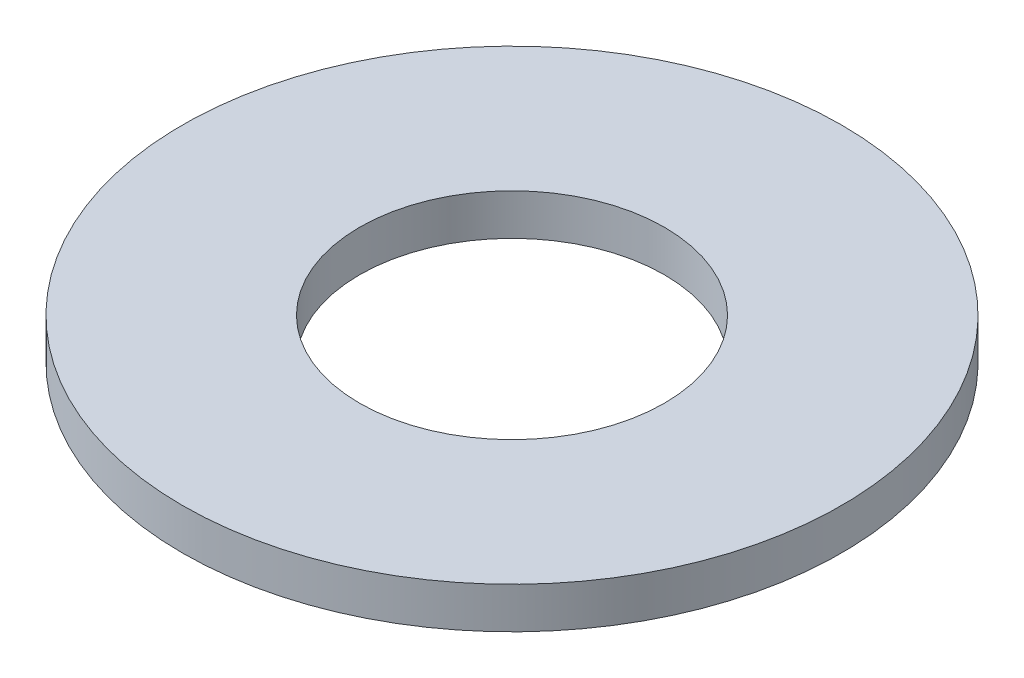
from build123d import *

# Parameters (mm, degrees)
SKETCH1_R      = 4
SKETCH1_R_2    = 1.85
EXTRUDE1_DEPTH = 0.5


with BuildPart() as part:
    # Sketch1 → Extrude1 (new body)
    with BuildSketch(Plane(origin=(0, 0, 0), x_dir=(1, 0, 0), z_dir=(0, 1, 0))):
        with Locations(Location((0, 0, 0), (0, 0, 270))):
            Circle(SKETCH1_R)
        with Locations(Location((0, 0, 0), (0, 0, 270))):
            Circle(SKETCH1_R_2, mode=Mode.SUBTRACT)
    extrude(amount=EXTRUDE1_DEPTH)


solid = part.part
